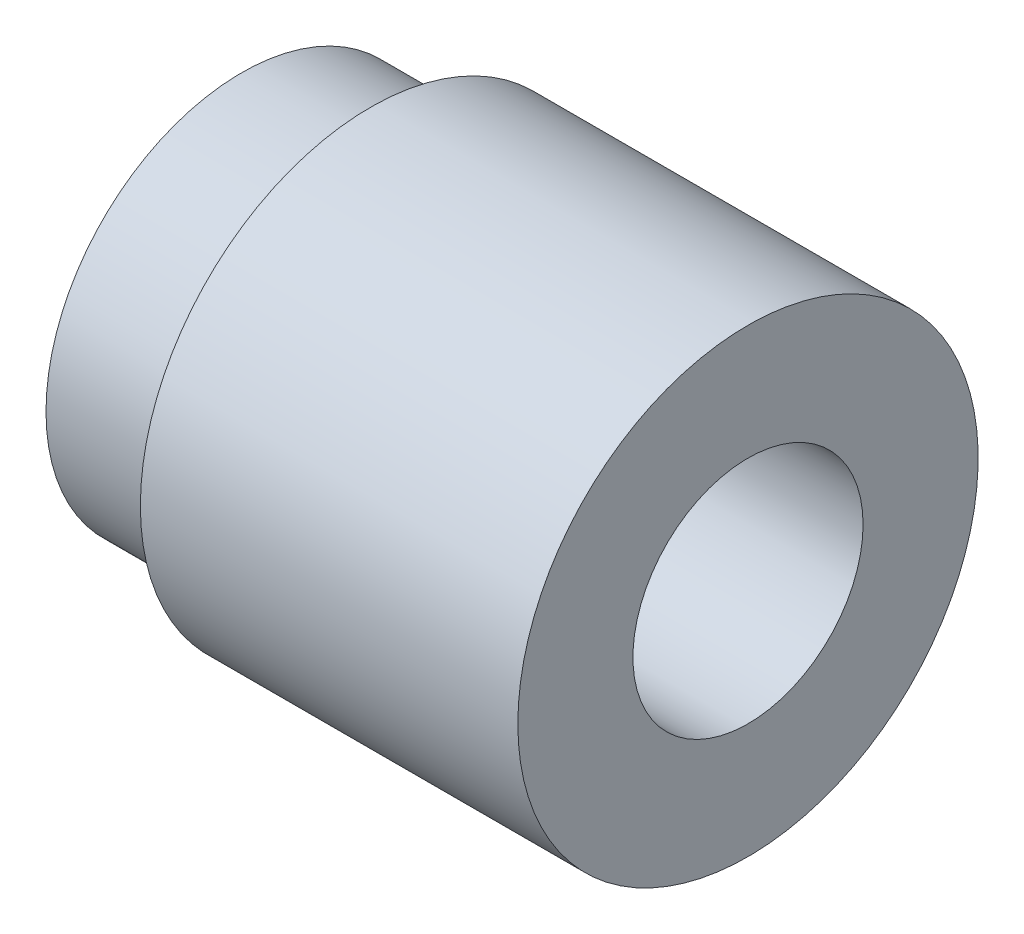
from build123d import *

# Parameters (mm, degrees)
OTW_R_GWINTOWANY_M31_D = 2.5


with BuildPart() as part:
    # Szkic1 → Obr_t1 (revolve)
    with BuildSketch(Plane.XY, mode=Mode.PRIVATE) as obr_t1_sk:
        Polygon((0, 0), (0, 2.125), (1.4, 2.125), (1.4, 2.5), (5.5, 2.5), (5.5, 0), align=None)
    revolve(obr_t1_sk.sketch.rotate(Axis((-0.158997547, 0, 0), (1, 0, 0)), 90), axis=Axis((-0.158997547, 0, 0), (1, 0, 0)))

    # Otw_r gwintowany M31 (through all)
    with Locations(Plane(origin=(5.5, 0, 0), x_dir=(0, 0, -1), z_dir=(1, 0, 0))):
        with Locations((0, 0)):
            Hole(OTW_R_GWINTOWANY_M31_D / 2)


solid = part.part
